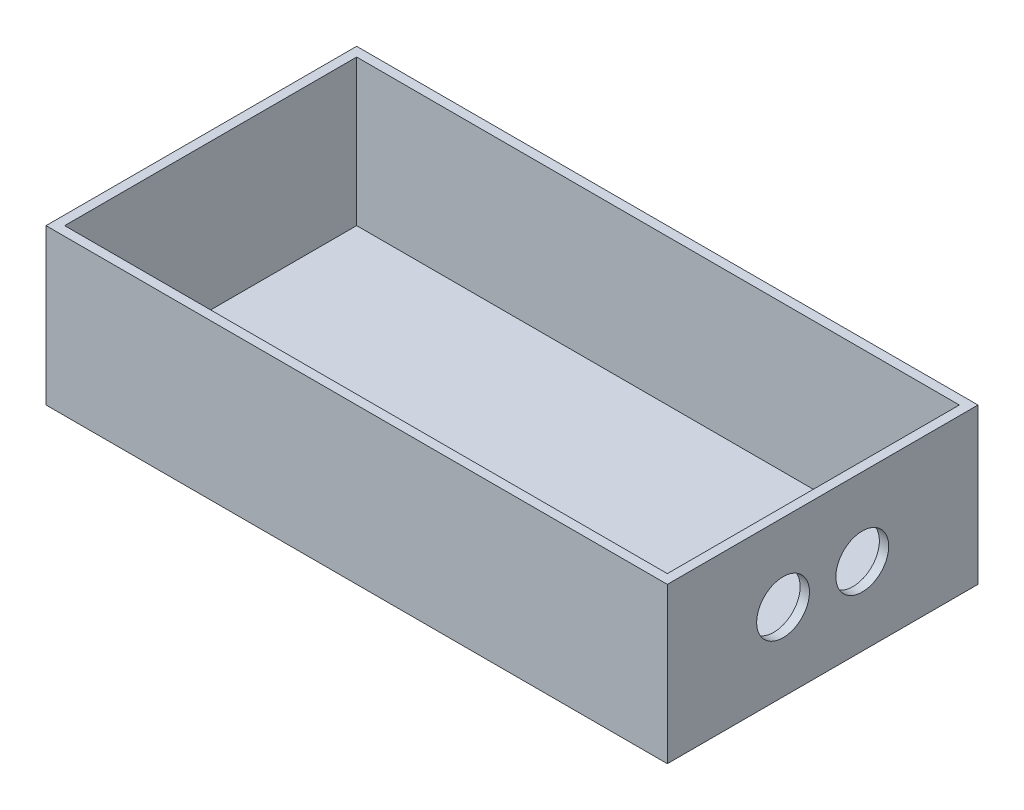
from build123d import *

# Parameters (mm, degrees)
SKETCH1_W               = 200
SKETCH1_H               = 50
BOSS_EXTRUDE1_DEPTH     = 100
SHELL1_T                = -3
CUT_EXTRUDE1_DEPTH      = 226
CUT_EXTRUDE1_DEPTH_BACK = 3
SKETCH2_R               = 8.5


with BuildPart() as part:
    # Sketch1 → Boss-Extrude1 (new body)
    with BuildSketch(Plane.XY):
        Rectangle(SKETCH1_W, SKETCH1_H)
    extrude(amount=BOSS_EXTRUDE1_DEPTH)

    # Shell1
    shell1_openings = [part.faces().sort_by_distance(p)[0] for p in [
        (0, 25, 50),
    ]]
    offset(amount=SHELL1_T, openings=shell1_openings, kind=Kind.INTERSECTION)

    # Sketch2 → Cut-Extrude1 (cut, two sides: drawn at the far end of the back side and taken through both)
    with BuildSketch(Plane(origin=(100, 0, 0), x_dir=(0, 0, -1), z_dir=(1, 0, 0)).offset(-CUT_EXTRUDE1_DEPTH_BACK)):
        with Locations(Location((-62.75, 0, 0), (0, 0, 180))):
            Circle(SKETCH2_R)
        with Locations(Location((-37.25, 0, 0), (0, 0, 180))):
            Circle(SKETCH2_R)
    extrude(amount=CUT_EXTRUDE1_DEPTH + CUT_EXTRUDE1_DEPTH_BACK, mode=Mode.SUBTRACT)


solid = part.part
